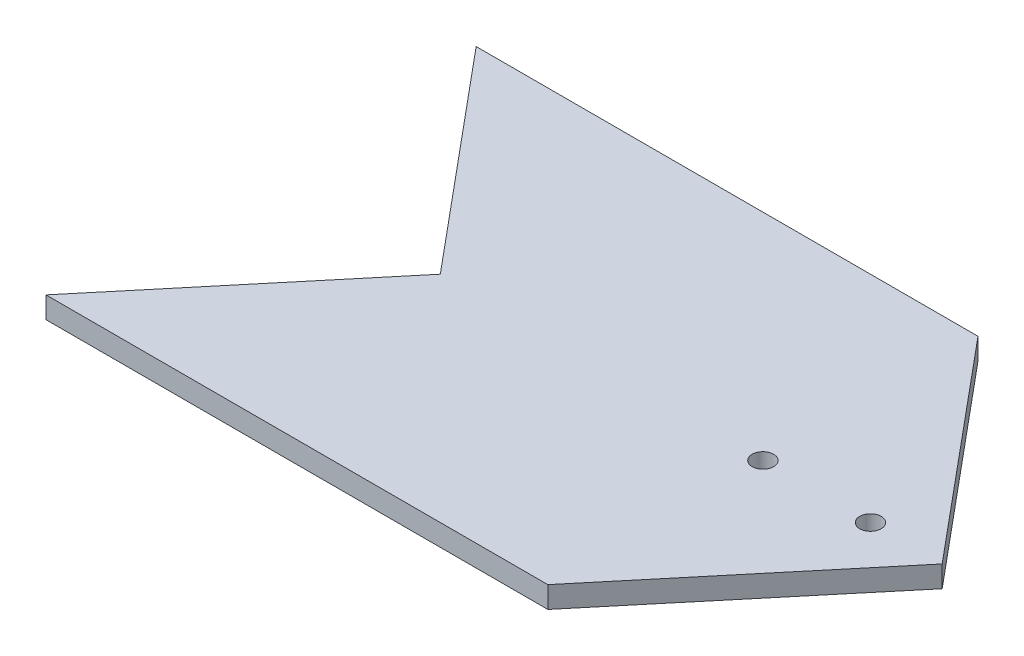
ISO-10303-21;
HEADER;
FILE_DESCRIPTION(('STEP AP214'),'2;1');
FILE_NAME('part.step','',(''),(''),'','','');
FILE_SCHEMA(('AUTOMOTIVE_DESIGN { 1 0 10303 214 1 1 1 1 }'));
ENDSEC;
DATA;
#1=APPLICATION_CONTEXT('core data for automotive mechanical design processes');
#2=APPLICATION_PROTOCOL_DEFINITION('international standard','automotive_design',2000,#1);
#3=PRODUCT_CONTEXT('',#1,'mechanical');
#4=PRODUCT('Part','Part','',(#3));
#5=PRODUCT_RELATED_PRODUCT_CATEGORY('part','',(#4));
#6=PRODUCT_DEFINITION_FORMATION('','',#4);
#7=PRODUCT_DEFINITION_CONTEXT('part definition',#1,'design');
#8=PRODUCT_DEFINITION('design','',#6,#7);
#9=PRODUCT_DEFINITION_SHAPE('','',#8);
#10=(LENGTH_UNIT() NAMED_UNIT(*) SI_UNIT(.MILLI.,.METRE.));
#11=(NAMED_UNIT(*) PLANE_ANGLE_UNIT() SI_UNIT($,.RADIAN.));
#12=(NAMED_UNIT(*) SI_UNIT($,.STERADIAN.) SOLID_ANGLE_UNIT());
#13=UNCERTAINTY_MEASURE_WITH_UNIT(LENGTH_MEASURE(1.E-05),#10,'distance_accuracy_value','');
#14=(GEOMETRIC_REPRESENTATION_CONTEXT(3) GLOBAL_UNCERTAINTY_ASSIGNED_CONTEXT((#13)) GLOBAL_UNIT_ASSIGNED_CONTEXT((#10,
#11,#12)) REPRESENTATION_CONTEXT('',''));
#15=CARTESIAN_POINT('',(0.,0.,0.));
#16=DIRECTION('',(0.,0.,1.));
#17=DIRECTION('',(1.,0.,0.));
#18=AXIS2_PLACEMENT_3D('',#15,#16,#17);
#19=CARTESIAN_POINT('',(60.,3.,-72.));
#20=DIRECTION('',(0.,-1.,0.));
#21=DIRECTION('',(0.,0.,-1.));
#22=AXIS2_PLACEMENT_3D('',#19,#20,#21);
#23=PLANE('',#22);
#24=CARTESIAN_POINT('',(85.,3.,-30.));
#25=DIRECTION('',(0.,1.,0.));
#26=DIRECTION('',(0.,0.,1.));
#27=AXIS2_PLACEMENT_3D('',#24,#25,#26);
#28=CIRCLE('',#27,1.5);
#29=CARTESIAN_POINT('',(85.,3.,-28.5));
#30=VERTEX_POINT('',#29);
#31=EDGE_CURVE('E102',#30,#30,#28,.T.);
#32=ORIENTED_EDGE('',*,*,#31,.F.);
#33=EDGE_LOOP('',(#32));
#34=FACE_BOUND('',#33,.T.);
#35=DIRECTION('',(-0.64018439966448,0.,0.768221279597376));
#36=VECTOR('',#35,1.);
#37=CARTESIAN_POINT('',(25.,3.,-30.));
#38=LINE('',#37,#36);
#39=CARTESIAN_POINT('',(25.,3.,-30.));
#40=VERTEX_POINT('',#39);
#41=CARTESIAN_POINT('',(0.,3.,0.));
#42=VERTEX_POINT('',#41);
#43=EDGE_CURVE('E116',#40,#42,#38,.T.);
#44=ORIENTED_EDGE('',*,*,#43,.T.);
#45=DIRECTION('',(1.,0.,0.));
#46=VECTOR('',#45,1.);
#47=CARTESIAN_POINT('',(0.,3.,0.));
#48=LINE('',#47,#46);
#49=CARTESIAN_POINT('',(70.,3.,0.));
#50=VERTEX_POINT('',#49);
#51=EDGE_CURVE('E97',#42,#50,#48,.T.);
#52=ORIENTED_EDGE('',*,*,#51,.T.);
#53=DIRECTION('',(0.64018439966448,0.,-0.768221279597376));
#54=VECTOR('',#53,1.);
#55=CARTESIAN_POINT('',(95.,3.,-30.));
#56=LINE('',#55,#54);
#57=CARTESIAN_POINT('',(95.,3.,-30.));
#58=VERTEX_POINT('',#57);
#59=EDGE_CURVE('E119',#50,#58,#56,.T.);
#60=ORIENTED_EDGE('',*,*,#59,.T.);
#61=DIRECTION('',(-0.64018439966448,0.,-0.768221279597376));
#62=VECTOR('',#61,1.);
#63=CARTESIAN_POINT('',(95.,3.,-30.));
#64=LINE('',#63,#62);
#65=CARTESIAN_POINT('',(70.,3.,-60.));
#66=VERTEX_POINT('',#65);
#67=EDGE_CURVE('E121',#58,#66,#64,.T.);
#68=ORIENTED_EDGE('',*,*,#67,.T.);
#69=DIRECTION('',(-1.,0.,0.));
#70=VECTOR('',#69,1.);
#71=CARTESIAN_POINT('',(0.,3.,-60.));
#72=LINE('',#71,#70);
#73=CARTESIAN_POINT('',(0.,3.,-60.));
#74=VERTEX_POINT('',#73);
#75=EDGE_CURVE('E50',#66,#74,#72,.T.);
#76=ORIENTED_EDGE('',*,*,#75,.T.);
#77=DIRECTION('',(0.64018439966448,0.,0.768221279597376));
#78=VECTOR('',#77,1.);
#79=CARTESIAN_POINT('',(0.,3.,-60.));
#80=LINE('',#79,#78);
#81=EDGE_CURVE('E45',#74,#40,#80,.T.);
#82=ORIENTED_EDGE('',*,*,#81,.T.);
#83=EDGE_LOOP('',(#44,#52,#60,#68,#76,#82));
#84=FACE_BOUND('',#83,.T.);
#85=CARTESIAN_POINT('',(70.,3.,-30.));
#86=DIRECTION('',(0.,1.,0.));
#87=DIRECTION('',(0.,0.,1.));
#88=AXIS2_PLACEMENT_3D('',#85,#86,#87);
#89=CIRCLE('',#88,1.5);
#90=CARTESIAN_POINT('',(70.,3.,-28.5));
#91=VERTEX_POINT('',#90);
#92=EDGE_CURVE('E176',#91,#91,#89,.T.);
#93=ORIENTED_EDGE('',*,*,#92,.F.);
#94=EDGE_LOOP('',(#93));
#95=FACE_BOUND('',#94,.T.);
#96=ADVANCED_FACE('F30',(#34,#84,#95),#23,.F.);
#97=CARTESIAN_POINT('',(60.,0.,-72.));
#98=DIRECTION('',(0.,-1.,0.));
#99=DIRECTION('',(0.,0.,-1.));
#100=AXIS2_PLACEMENT_3D('',#97,#98,#99);
#101=PLANE('',#100);
#102=CARTESIAN_POINT('',(85.,0.,-30.));
#103=DIRECTION('',(0.,1.,0.));
#104=DIRECTION('',(0.,0.,1.));
#105=AXIS2_PLACEMENT_3D('',#102,#103,#104);
#106=CIRCLE('',#105,1.5);
#107=CARTESIAN_POINT('',(85.,0.,-28.5));
#108=VERTEX_POINT('',#107);
#109=EDGE_CURVE('E105',#108,#108,#106,.T.);
#110=ORIENTED_EDGE('',*,*,#109,.T.);
#111=EDGE_LOOP('',(#110));
#112=FACE_BOUND('',#111,.T.);
#113=DIRECTION('',(-0.64018439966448,0.,0.768221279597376));
#114=VECTOR('',#113,1.);
#115=CARTESIAN_POINT('',(25.,0.,-30.));
#116=LINE('',#115,#114);
#117=CARTESIAN_POINT('',(25.,0.,-30.));
#118=VERTEX_POINT('',#117);
#119=CARTESIAN_POINT('',(0.,0.,0.));
#120=VERTEX_POINT('',#119);
#121=EDGE_CURVE('E88',#118,#120,#116,.T.);
#122=ORIENTED_EDGE('',*,*,#121,.F.);
#123=DIRECTION('',(0.64018439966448,0.,0.768221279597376));
#124=VECTOR('',#123,1.);
#125=CARTESIAN_POINT('',(0.,0.,-60.));
#126=LINE('',#125,#124);
#127=CARTESIAN_POINT('',(0.,0.,-60.));
#128=VERTEX_POINT('',#127);
#129=EDGE_CURVE('E114',#128,#118,#126,.T.);
#130=ORIENTED_EDGE('',*,*,#129,.F.);
#131=DIRECTION('',(-1.,0.,0.));
#132=VECTOR('',#131,1.);
#133=CARTESIAN_POINT('',(0.,0.,-60.));
#134=LINE('',#133,#132);
#135=CARTESIAN_POINT('',(70.,0.,-60.));
#136=VERTEX_POINT('',#135);
#137=EDGE_CURVE('E112',#136,#128,#134,.T.);
#138=ORIENTED_EDGE('',*,*,#137,.F.);
#139=DIRECTION('',(-0.64018439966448,0.,-0.768221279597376));
#140=VECTOR('',#139,1.);
#141=CARTESIAN_POINT('',(95.,0.,-30.));
#142=LINE('',#141,#140);
#143=CARTESIAN_POINT('',(95.,0.,-30.));
#144=VERTEX_POINT('',#143);
#145=EDGE_CURVE('E110',#144,#136,#142,.T.);
#146=ORIENTED_EDGE('',*,*,#145,.F.);
#147=DIRECTION('',(0.64018439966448,0.,-0.768221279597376));
#148=VECTOR('',#147,1.);
#149=CARTESIAN_POINT('',(95.,0.,-30.));
#150=LINE('',#149,#148);
#151=CARTESIAN_POINT('',(70.,0.,0.));
#152=VERTEX_POINT('',#151);
#153=EDGE_CURVE('E90',#152,#144,#150,.T.);
#154=ORIENTED_EDGE('',*,*,#153,.F.);
#155=DIRECTION('',(1.,0.,0.));
#156=VECTOR('',#155,1.);
#157=CARTESIAN_POINT('',(0.,0.,0.));
#158=LINE('',#157,#156);
#159=EDGE_CURVE('E83',#120,#152,#158,.T.);
#160=ORIENTED_EDGE('',*,*,#159,.F.);
#161=EDGE_LOOP('',(#122,#130,#138,#146,#154,#160));
#162=FACE_BOUND('',#161,.T.);
#163=CARTESIAN_POINT('',(70.,0.,-30.));
#164=DIRECTION('',(0.,1.,0.));
#165=DIRECTION('',(0.,0.,1.));
#166=AXIS2_PLACEMENT_3D('',#163,#164,#165);
#167=CIRCLE('',#166,1.5);
#168=CARTESIAN_POINT('',(70.,0.,-28.5));
#169=VERTEX_POINT('',#168);
#170=EDGE_CURVE('E179',#169,#169,#167,.T.);
#171=ORIENTED_EDGE('',*,*,#170,.T.);
#172=EDGE_LOOP('',(#171));
#173=FACE_BOUND('',#172,.T.);
#174=ADVANCED_FACE('F84',(#112,#162,#173),#101,.T.);
#175=CARTESIAN_POINT('',(25.,3.,-30.));
#176=DIRECTION('',(0.768221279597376,0.,0.64018439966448));
#177=DIRECTION('',(0.64018439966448,0.,-0.768221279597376));
#178=AXIS2_PLACEMENT_3D('',#175,#176,#177);
#179=PLANE('',#178);
#180=ORIENTED_EDGE('',*,*,#121,.T.);
#181=DIRECTION('',(0.,-1.,0.));
#182=VECTOR('',#181,1.);
#183=CARTESIAN_POINT('',(0.,3.,0.));
#184=LINE('',#183,#182);
#185=EDGE_CURVE('E11',#42,#120,#184,.T.);
#186=ORIENTED_EDGE('',*,*,#185,.F.);
#187=ORIENTED_EDGE('',*,*,#43,.F.);
#188=DIRECTION('',(0.,-1.,0.));
#189=VECTOR('',#188,1.);
#190=CARTESIAN_POINT('',(25.,3.,-30.));
#191=LINE('',#190,#189);
#192=EDGE_CURVE('E101',#40,#118,#191,.T.);
#193=ORIENTED_EDGE('',*,*,#192,.T.);
#194=EDGE_LOOP('',(#180,#186,#187,#193));
#195=FACE_BOUND('',#194,.T.);
#196=ADVANCED_FACE('F32',(#195),#179,.F.);
#197=CARTESIAN_POINT('',(0.,3.,0.));
#198=DIRECTION('',(0.,0.,-1.));
#199=DIRECTION('',(-1.,0.,0.));
#200=AXIS2_PLACEMENT_3D('',#197,#198,#199);
#201=PLANE('',#200);
#202=ORIENTED_EDGE('',*,*,#159,.T.);
#203=DIRECTION('',(0.,-1.,0.));
#204=VECTOR('',#203,1.);
#205=CARTESIAN_POINT('',(70.,3.,0.));
#206=LINE('',#205,#204);
#207=EDGE_CURVE('E38',#50,#152,#206,.T.);
#208=ORIENTED_EDGE('',*,*,#207,.F.);
#209=ORIENTED_EDGE('',*,*,#51,.F.);
#210=ORIENTED_EDGE('',*,*,#185,.T.);
#211=EDGE_LOOP('',(#202,#208,#209,#210));
#212=FACE_BOUND('',#211,.T.);
#213=ADVANCED_FACE('F96',(#212),#201,.F.);
#214=CARTESIAN_POINT('',(95.,3.,-30.));
#215=DIRECTION('',(-0.768221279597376,0.,-0.64018439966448));
#216=DIRECTION('',(-0.64018439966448,0.,0.768221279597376));
#217=AXIS2_PLACEMENT_3D('',#214,#215,#216);
#218=PLANE('',#217);
#219=ORIENTED_EDGE('',*,*,#153,.T.);
#220=DIRECTION('',(0.,-1.,0.));
#221=VECTOR('',#220,1.);
#222=CARTESIAN_POINT('',(95.,3.,-30.));
#223=LINE('',#222,#221);
#224=EDGE_CURVE('E132',#58,#144,#223,.T.);
#225=ORIENTED_EDGE('',*,*,#224,.F.);
#226=ORIENTED_EDGE('',*,*,#59,.F.);
#227=ORIENTED_EDGE('',*,*,#207,.T.);
#228=EDGE_LOOP('',(#219,#225,#226,#227));
#229=FACE_BOUND('',#228,.T.);
#230=ADVANCED_FACE('F136',(#229),#218,.F.);
#231=CARTESIAN_POINT('',(95.,3.,-30.));
#232=DIRECTION('',(-0.768221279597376,0.,0.64018439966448));
#233=DIRECTION('',(0.64018439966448,0.,0.768221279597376));
#234=AXIS2_PLACEMENT_3D('',#231,#232,#233);
#235=PLANE('',#234);
#236=ORIENTED_EDGE('',*,*,#145,.T.);
#237=DIRECTION('',(0.,-1.,0.));
#238=VECTOR('',#237,1.);
#239=CARTESIAN_POINT('',(70.,3.,-60.));
#240=LINE('',#239,#238);
#241=EDGE_CURVE('E129',#66,#136,#240,.T.);
#242=ORIENTED_EDGE('',*,*,#241,.F.);
#243=ORIENTED_EDGE('',*,*,#67,.F.);
#244=ORIENTED_EDGE('',*,*,#224,.T.);
#245=EDGE_LOOP('',(#236,#242,#243,#244));
#246=FACE_BOUND('',#245,.T.);
#247=ADVANCED_FACE('F142',(#246),#235,.F.);
#248=CARTESIAN_POINT('',(0.,3.,-60.));
#249=DIRECTION('',(0.,0.,1.));
#250=DIRECTION('',(1.,0.,0.));
#251=AXIS2_PLACEMENT_3D('',#248,#249,#250);
#252=PLANE('',#251);
#253=ORIENTED_EDGE('',*,*,#137,.T.);
#254=DIRECTION('',(0.,-1.,0.));
#255=VECTOR('',#254,1.);
#256=CARTESIAN_POINT('',(0.,3.,-60.));
#257=LINE('',#256,#255);
#258=EDGE_CURVE('E126',#74,#128,#257,.T.);
#259=ORIENTED_EDGE('',*,*,#258,.F.);
#260=ORIENTED_EDGE('',*,*,#75,.F.);
#261=ORIENTED_EDGE('',*,*,#241,.T.);
#262=EDGE_LOOP('',(#253,#259,#260,#261));
#263=FACE_BOUND('',#262,.T.);
#264=ADVANCED_FACE('F145',(#263),#252,.F.);
#265=CARTESIAN_POINT('',(0.,3.,-60.));
#266=DIRECTION('',(0.768221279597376,0.,-0.64018439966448));
#267=DIRECTION('',(-0.64018439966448,0.,-0.768221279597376));
#268=AXIS2_PLACEMENT_3D('',#265,#266,#267);
#269=PLANE('',#268);
#270=ORIENTED_EDGE('',*,*,#129,.T.);
#271=ORIENTED_EDGE('',*,*,#192,.F.);
#272=ORIENTED_EDGE('',*,*,#81,.F.);
#273=ORIENTED_EDGE('',*,*,#258,.T.);
#274=EDGE_LOOP('',(#270,#271,#272,#273));
#275=FACE_BOUND('',#274,.T.);
#276=ADVANCED_FACE('F147',(#275),#269,.F.);
#277=CARTESIAN_POINT('',(85.,3.,-30.));
#278=DIRECTION('',(0.,-1.,0.));
#279=DIRECTION('',(0.,0.,-1.));
#280=AXIS2_PLACEMENT_3D('',#277,#278,#279);
#281=CYLINDRICAL_SURFACE('',#280,1.5);
#282=ORIENTED_EDGE('',*,*,#31,.T.);
#283=EDGE_LOOP('',(#282));
#284=FACE_BOUND('',#283,.T.);
#285=ORIENTED_EDGE('',*,*,#109,.F.);
#286=EDGE_LOOP('',(#285));
#287=FACE_BOUND('',#286,.T.);
#288=ADVANCED_FACE('F149',(#284,#287),#281,.F.);
#289=CARTESIAN_POINT('',(70.,3.,-30.));
#290=DIRECTION('',(0.,-1.,0.));
#291=DIRECTION('',(0.,0.,-1.));
#292=AXIS2_PLACEMENT_3D('',#289,#290,#291);
#293=CYLINDRICAL_SURFACE('',#292,1.5);
#294=ORIENTED_EDGE('',*,*,#92,.T.);
#295=EDGE_LOOP('',(#294));
#296=FACE_BOUND('',#295,.T.);
#297=ORIENTED_EDGE('',*,*,#170,.F.);
#298=EDGE_LOOP('',(#297));
#299=FACE_BOUND('',#298,.T.);
#300=ADVANCED_FACE('F155',(#296,#299),#293,.F.);
#301=CLOSED_SHELL('',(#96,#174,#196,#213,#230,#247,#264,#276,#288,#300));
#302=MANIFOLD_SOLID_BREP('B2',#301);
#303=ADVANCED_BREP_SHAPE_REPRESENTATION('',(#18,#302),#14);
#304=SHAPE_DEFINITION_REPRESENTATION(#9,#303);
ENDSEC;
END-ISO-10303-21;
